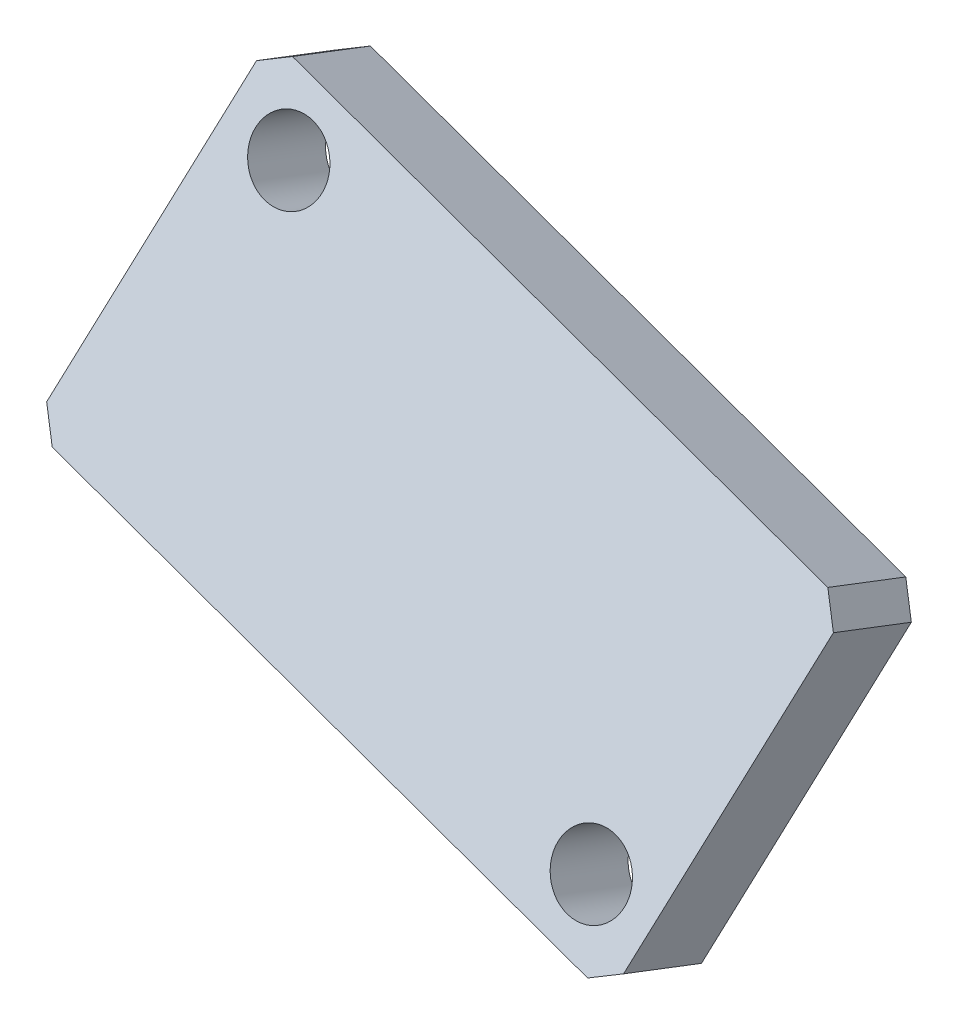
from build123d import *

# Parameters (mm, degrees)
ESQUISSE1_R        = 1.6
BOSS_EXTRU_1_DEPTH = 4
CHANFREIN1_SIZE    = 1


with BuildPart() as part:
    # Esquisse1 → Boss.-Extru.1 (new body)
    with BuildSketch(Plane(origin=(-14.413000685, -87.976509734, -206.296510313), x_dir=(0.9978554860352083, -0.013090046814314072, -0.06413329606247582), z_dir=(0.06413329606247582, 0.391467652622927, 0.9179542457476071))):
        Polygon((39.313867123, 82.208538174), (43.833860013, 97.348210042), (70.472016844, 89.395311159), (65.952023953, 74.255639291), align=None)
        with Locations(Location((64.041447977, 77.643809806, 0), (0, 0, 269.248426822))):
            Circle(ESQUISSE1_R, mode=Mode.SUBTRACT)
        with Locations(Location((45.744435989, 93.960039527, 0), (0, 0, 269.248426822))):
            Circle(ESQUISSE1_R, mode=Mode.SUBTRACT)
    extrude(amount=BOSS_EXTRU_1_DEPTH)

    # Chanfrein1
    chanfrein1_edges = [part.edges().sort_by_distance(p)[0] for p in [
        (54.865965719, -5.863541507, -243.975577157),
        (50.55384503, -19.734367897, -237.759003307),
        (23.86871028, -12.068220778, -239.163913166),
        (28.180830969, 1.802605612, -245.380487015),
    ]]
    chamfer(chanfrein1_edges, length=CHANFREIN1_SIZE)


solid = part.part
